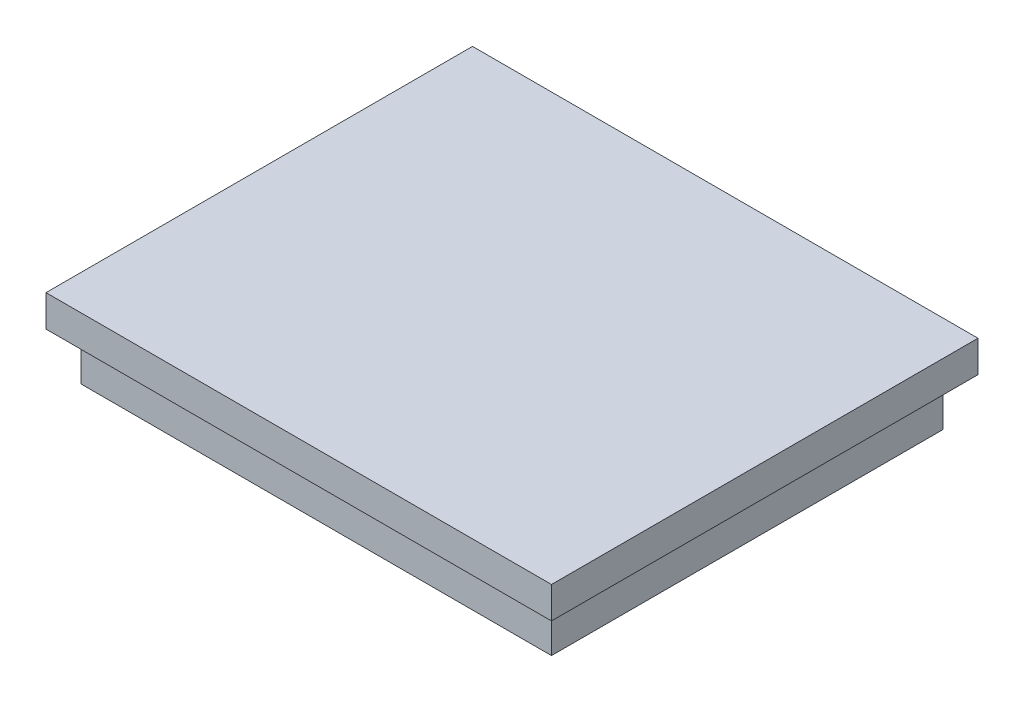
from build123d import *

# Parameters (mm, degrees)
SKETCH1_W           = 29.8
SKETCH1_H           = 24.8
BOSS_EXTRUDE1_DEPTH = 3
SKETCH2_W           = 32
SKETCH2_H           = 27
BOSS_EXTRUDE2_DEPTH = 2


with BuildPart() as part:
    # Sketch1 → Boss-Extrude1 (new body)
    with BuildSketch(Plane(origin=(0, 0, 0), x_dir=(1, 0, 0), z_dir=(0, 1, 0))):
        Rectangle(SKETCH1_W, SKETCH1_H)
    extrude(amount=BOSS_EXTRUDE1_DEPTH)

    # Sketch2 → Boss-Extrude2 (add)
    with BuildSketch(Plane(origin=(0, 3, 0), x_dir=(1, 0, 0), z_dir=(0, 1, 0))):
        Rectangle(SKETCH2_W, SKETCH2_H)
    extrude(amount=BOSS_EXTRUDE2_DEPTH)


solid = part.part
